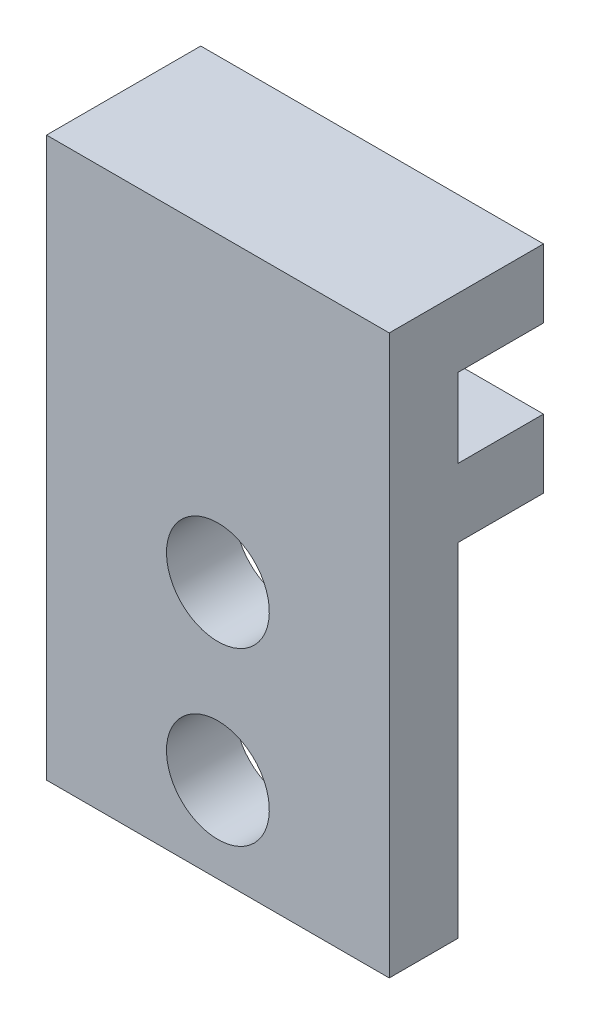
from build123d import *

# Parameters (mm, degrees)
BOSS_EXTRU_1_DEPTH      = 20
ESQUISSE3_R             = 3
ENL_V_MAT_EXTRU_1_DEPTH = 39.571492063


with BuildPart() as part:
    # Esquisse2 → Boss.-Extru.1 (new body)
    with BuildSketch(Plane(origin=(0, 0, 0), x_dir=(0, 0, -1), z_dir=(1, 0, 0))):
        Polygon((0, 0), (9, 0), (9, -4), (4, -4), (4, -8.6), (9, -8.6), (9, -12.6), (4, -12.6), (4, -32.6), (0, -32.6), align=None)
    extrude(amount=BOSS_EXTRU_1_DEPTH)

    # Esquisse3 → Enl_v. mat.-Extru.1 (cut, through all)
    with BuildSketch(Plane(origin=(0, 0, -4), x_dir=(-1, 0, 0), z_dir=(0, 0, -1))):
        with Locations(Location((-10, -17.6, 0), (0, 0, 90))):
            Circle(ESQUISSE3_R)
        with Locations(Location((-10, -27.6, 0), (0, 0, 90))):
            Circle(ESQUISSE3_R)
    extrude(amount=-ENL_V_MAT_EXTRU_1_DEPTH, mode=Mode.SUBTRACT)


solid = part.part
